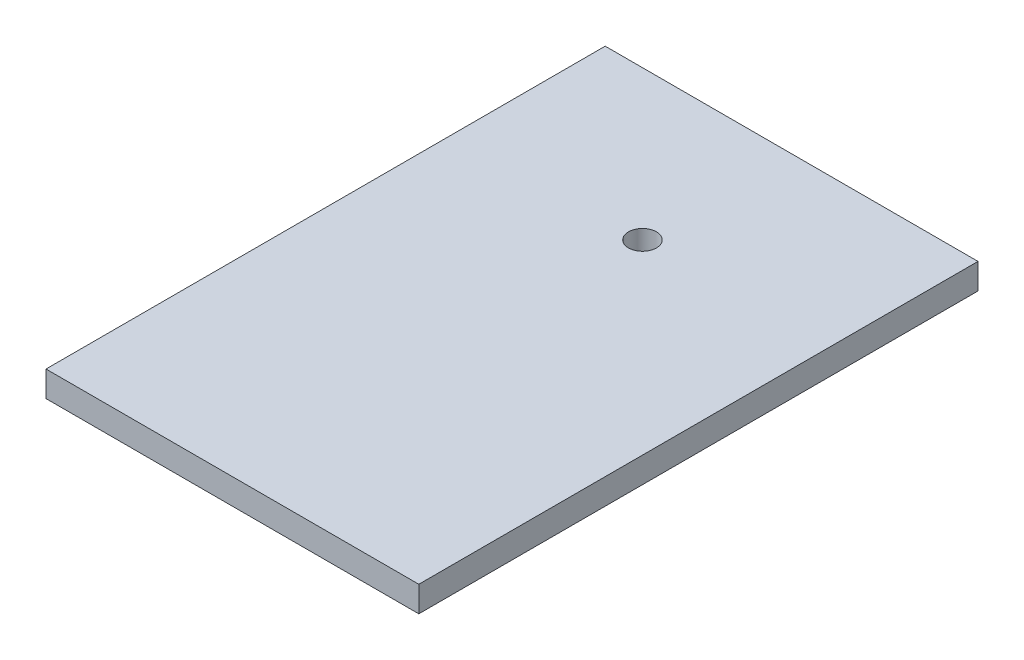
ISO-10303-21;
HEADER;
FILE_DESCRIPTION(('STEP AP214'),'2;1');
FILE_NAME('part.step','',(''),(''),'','','');
FILE_SCHEMA(('AUTOMOTIVE_DESIGN { 1 0 10303 214 1 1 1 1 }'));
ENDSEC;
DATA;
#1=APPLICATION_CONTEXT('core data for automotive mechanical design processes');
#2=APPLICATION_PROTOCOL_DEFINITION('international standard','automotive_design',2000,#1);
#3=PRODUCT_CONTEXT('',#1,'mechanical');
#4=PRODUCT('Part','Part','',(#3));
#5=PRODUCT_RELATED_PRODUCT_CATEGORY('part','',(#4));
#6=PRODUCT_DEFINITION_FORMATION('','',#4);
#7=PRODUCT_DEFINITION_CONTEXT('part definition',#1,'design');
#8=PRODUCT_DEFINITION('design','',#6,#7);
#9=PRODUCT_DEFINITION_SHAPE('','',#8);
#10=(LENGTH_UNIT() NAMED_UNIT(*) SI_UNIT(.MILLI.,.METRE.));
#11=(NAMED_UNIT(*) PLANE_ANGLE_UNIT() SI_UNIT($,.RADIAN.));
#12=(NAMED_UNIT(*) SI_UNIT($,.STERADIAN.) SOLID_ANGLE_UNIT());
#13=UNCERTAINTY_MEASURE_WITH_UNIT(LENGTH_MEASURE(1.E-05),#10,'distance_accuracy_value','');
#14=(GEOMETRIC_REPRESENTATION_CONTEXT(3) GLOBAL_UNCERTAINTY_ASSIGNED_CONTEXT((#13)) GLOBAL_UNIT_ASSIGNED_CONTEXT((#10,
#11,#12)) REPRESENTATION_CONTEXT('',''));
#15=CARTESIAN_POINT('',(0.,0.,0.));
#16=DIRECTION('',(0.,0.,1.));
#17=DIRECTION('',(1.,0.,0.));
#18=AXIS2_PLACEMENT_3D('',#15,#16,#17);
#19=CARTESIAN_POINT('',(-127.,-8.73125,-381.));
#20=DIRECTION('',(1.,0.,0.));
#21=DIRECTION('',(0.,0.,-1.));
#22=AXIS2_PLACEMENT_3D('',#19,#20,#21);
#23=PLANE('',#22);
#24=DIRECTION('',(0.,1.,0.));
#25=VECTOR('',#24,1.);
#26=CARTESIAN_POINT('',(-127.,-8.73125,0.));
#27=LINE('',#26,#25);
#28=CARTESIAN_POINT('',(-127.,-8.73125,0.));
#29=VERTEX_POINT('',#28);
#30=CARTESIAN_POINT('',(-127.,8.73125,0.));
#31=VERTEX_POINT('',#30);
#32=EDGE_CURVE('E107',#29,#31,#27,.T.);
#33=ORIENTED_EDGE('',*,*,#32,.T.);
#34=DIRECTION('',(0.,0.,1.));
#35=VECTOR('',#34,1.);
#36=CARTESIAN_POINT('',(-127.,8.73125,-381.));
#37=LINE('',#36,#35);
#38=CARTESIAN_POINT('',(-127.,8.73125,-381.));
#39=VERTEX_POINT('',#38);
#40=EDGE_CURVE('E13',#39,#31,#37,.T.);
#41=ORIENTED_EDGE('',*,*,#40,.F.);
#42=DIRECTION('',(0.,1.,0.));
#43=VECTOR('',#42,1.);
#44=CARTESIAN_POINT('',(-127.,-8.73125,-381.));
#45=LINE('',#44,#43);
#46=CARTESIAN_POINT('',(-127.,-8.73125,-381.));
#47=VERTEX_POINT('',#46);
#48=EDGE_CURVE('E93',#47,#39,#45,.T.);
#49=ORIENTED_EDGE('',*,*,#48,.F.);
#50=DIRECTION('',(0.,0.,1.));
#51=VECTOR('',#50,1.);
#52=CARTESIAN_POINT('',(-127.,-8.73125,-381.));
#53=LINE('',#52,#51);
#54=EDGE_CURVE('E60',#47,#29,#53,.T.);
#55=ORIENTED_EDGE('',*,*,#54,.T.);
#56=EDGE_LOOP('',(#33,#41,#49,#55));
#57=FACE_BOUND('',#56,.T.);
#58=ADVANCED_FACE('F44',(#57),#23,.F.);
#59=CARTESIAN_POINT('',(-127.,8.73125,-381.));
#60=DIRECTION('',(0.,-1.,0.));
#61=DIRECTION('',(0.,0.,-1.));
#62=AXIS2_PLACEMENT_3D('',#59,#60,#61);
#63=PLANE('',#62);
#64=CARTESIAN_POINT('',(0.,8.73125,-279.4));
#65=DIRECTION('',(0.,1.,0.));
#66=DIRECTION('',(0.,0.,1.));
#67=AXIS2_PLACEMENT_3D('',#64,#65,#66);
#68=CIRCLE('',#67,9.52499999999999);
#69=CARTESIAN_POINT('',(0.,8.73125,-269.875));
#70=VERTEX_POINT('',#69);
#71=EDGE_CURVE('E119',#70,#70,#68,.T.);
#72=ORIENTED_EDGE('',*,*,#71,.F.);
#73=EDGE_LOOP('',(#72));
#74=FACE_BOUND('',#73,.T.);
#75=DIRECTION('',(1.,0.,0.));
#76=VECTOR('',#75,1.);
#77=CARTESIAN_POINT('',(-127.,8.73125,0.));
#78=LINE('',#77,#76);
#79=CARTESIAN_POINT('',(127.,8.73125,0.));
#80=VERTEX_POINT('',#79);
#81=EDGE_CURVE('E98',#31,#80,#78,.T.);
#82=ORIENTED_EDGE('',*,*,#81,.T.);
#83=DIRECTION('',(0.,0.,1.));
#84=VECTOR('',#83,1.);
#85=CARTESIAN_POINT('',(127.,8.73125,-381.));
#86=LINE('',#85,#84);
#87=CARTESIAN_POINT('',(127.,8.73125,-381.));
#88=VERTEX_POINT('',#87);
#89=EDGE_CURVE('E52',#88,#80,#86,.T.);
#90=ORIENTED_EDGE('',*,*,#89,.F.);
#91=DIRECTION('',(1.,0.,0.));
#92=VECTOR('',#91,1.);
#93=CARTESIAN_POINT('',(-127.,8.73125,-381.));
#94=LINE('',#93,#92);
#95=EDGE_CURVE('E85',#39,#88,#94,.T.);
#96=ORIENTED_EDGE('',*,*,#95,.F.);
#97=ORIENTED_EDGE('',*,*,#40,.T.);
#98=EDGE_LOOP('',(#82,#90,#96,#97));
#99=FACE_BOUND('',#98,.T.);
#100=ADVANCED_FACE('F97',(#74,#99),#63,.F.);
#101=CARTESIAN_POINT('',(127.,-8.73125,-381.));
#102=DIRECTION('',(1.,0.,0.));
#103=DIRECTION('',(0.,0.,-1.));
#104=AXIS2_PLACEMENT_3D('',#101,#102,#103);
#105=PLANE('',#104);
#106=DIRECTION('',(0.,1.,0.));
#107=VECTOR('',#106,1.);
#108=CARTESIAN_POINT('',(127.,-8.73125,0.));
#109=LINE('',#108,#107);
#110=CARTESIAN_POINT('',(127.,-8.73125,0.));
#111=VERTEX_POINT('',#110);
#112=EDGE_CURVE('E111',#111,#80,#109,.T.);
#113=ORIENTED_EDGE('',*,*,#112,.F.);
#114=DIRECTION('',(0.,0.,1.));
#115=VECTOR('',#114,1.);
#116=CARTESIAN_POINT('',(127.,-8.73125,-381.));
#117=LINE('',#116,#115);
#118=CARTESIAN_POINT('',(127.,-8.73125,-381.));
#119=VERTEX_POINT('',#118);
#120=EDGE_CURVE('E74',#119,#111,#117,.T.);
#121=ORIENTED_EDGE('',*,*,#120,.F.);
#122=DIRECTION('',(0.,1.,0.));
#123=VECTOR('',#122,1.);
#124=CARTESIAN_POINT('',(127.,-8.73125,-381.));
#125=LINE('',#124,#123);
#126=EDGE_CURVE('E92',#119,#88,#125,.T.);
#127=ORIENTED_EDGE('',*,*,#126,.T.);
#128=ORIENTED_EDGE('',*,*,#89,.T.);
#129=EDGE_LOOP('',(#113,#121,#127,#128));
#130=FACE_BOUND('',#129,.T.);
#131=ADVANCED_FACE('F101',(#130),#105,.T.);
#132=CARTESIAN_POINT('',(-127.,-8.73125,-381.));
#133=DIRECTION('',(0.,-1.,0.));
#134=DIRECTION('',(0.,0.,-1.));
#135=AXIS2_PLACEMENT_3D('',#132,#133,#134);
#136=PLANE('',#135);
#137=CARTESIAN_POINT('',(0.,-8.73125,-279.4));
#138=DIRECTION('',(0.,1.,0.));
#139=DIRECTION('',(0.,0.,1.));
#140=AXIS2_PLACEMENT_3D('',#137,#138,#139);
#141=CIRCLE('',#140,9.52499999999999);
#142=CARTESIAN_POINT('',(0.,-8.73125,-269.875));
#143=VERTEX_POINT('',#142);
#144=EDGE_CURVE('E109',#143,#143,#141,.T.);
#145=ORIENTED_EDGE('',*,*,#144,.T.);
#146=EDGE_LOOP('',(#145));
#147=FACE_BOUND('',#146,.T.);
#148=DIRECTION('',(1.,0.,0.));
#149=VECTOR('',#148,1.);
#150=CARTESIAN_POINT('',(-127.,-8.73125,0.));
#151=LINE('',#150,#149);
#152=EDGE_CURVE('E113',#29,#111,#151,.T.);
#153=ORIENTED_EDGE('',*,*,#152,.F.);
#154=ORIENTED_EDGE('',*,*,#54,.F.);
#155=DIRECTION('',(1.,0.,0.));
#156=VECTOR('',#155,1.);
#157=CARTESIAN_POINT('',(-127.,-8.73125,-381.));
#158=LINE('',#157,#156);
#159=EDGE_CURVE('E102',#47,#119,#158,.T.);
#160=ORIENTED_EDGE('',*,*,#159,.T.);
#161=ORIENTED_EDGE('',*,*,#120,.T.);
#162=EDGE_LOOP('',(#153,#154,#160,#161));
#163=FACE_BOUND('',#162,.T.);
#164=ADVANCED_FACE('F125',(#147,#163),#136,.T.);
#165=CARTESIAN_POINT('',(0.,0.,-381.));
#166=DIRECTION('',(0.,0.,-1.));
#167=DIRECTION('',(-1.,0.,0.));
#168=AXIS2_PLACEMENT_3D('',#165,#166,#167);
#169=PLANE('',#168);
#170=ORIENTED_EDGE('',*,*,#48,.T.);
#171=ORIENTED_EDGE('',*,*,#95,.T.);
#172=ORIENTED_EDGE('',*,*,#126,.F.);
#173=ORIENTED_EDGE('',*,*,#159,.F.);
#174=EDGE_LOOP('',(#170,#171,#172,#173));
#175=FACE_BOUND('',#174,.T.);
#176=ADVANCED_FACE('F89',(#175),#169,.T.);
#177=CARTESIAN_POINT('',(0.,0.,0.));
#178=DIRECTION('',(0.,0.,-1.));
#179=DIRECTION('',(-1.,0.,0.));
#180=AXIS2_PLACEMENT_3D('',#177,#178,#179);
#181=PLANE('',#180);
#182=ORIENTED_EDGE('',*,*,#32,.F.);
#183=ORIENTED_EDGE('',*,*,#152,.T.);
#184=ORIENTED_EDGE('',*,*,#112,.T.);
#185=ORIENTED_EDGE('',*,*,#81,.F.);
#186=EDGE_LOOP('',(#182,#183,#184,#185));
#187=FACE_BOUND('',#186,.T.);
#188=ADVANCED_FACE('F130',(#187),#181,.F.);
#189=CARTESIAN_POINT('',(0.,-8.73125,-279.4));
#190=DIRECTION('',(0.,1.,0.));
#191=DIRECTION('',(0.,0.,1.));
#192=AXIS2_PLACEMENT_3D('',#189,#190,#191);
#193=CYLINDRICAL_SURFACE('',#192,9.52499999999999);
#194=ORIENTED_EDGE('',*,*,#144,.F.);
#195=EDGE_LOOP('',(#194));
#196=FACE_BOUND('',#195,.T.);
#197=ORIENTED_EDGE('',*,*,#71,.T.);
#198=EDGE_LOOP('',(#197));
#199=FACE_BOUND('',#198,.T.);
#200=ADVANCED_FACE('F127',(#196,#199),#193,.F.);
#201=CLOSED_SHELL('',(#58,#100,#131,#164,#176,#188,#200));
#202=MANIFOLD_SOLID_BREP('B2',#201);
#203=ADVANCED_BREP_SHAPE_REPRESENTATION('',(#18,#202),#14);
#204=SHAPE_DEFINITION_REPRESENTATION(#9,#203);
ENDSEC;
END-ISO-10303-21;
